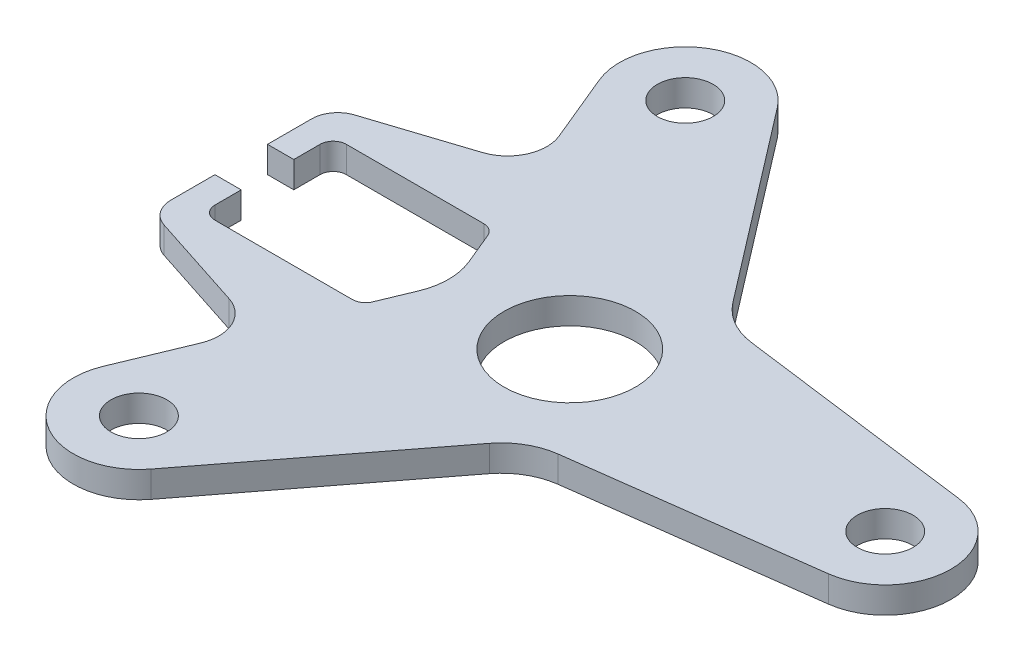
from build123d import *

# Parameters (mm, degrees)
ESQUISSE1_R        = 2.125
ESQUISSE1_R_2      = 5
BOSS_EXTRU_1_DEPTH = 1


with BuildPart() as part:
    # Esquisse1 → Boss.-Extru.1 (new, symmetric)
    with BuildSketch(Plane(origin=(0, 0, 0), x_dir=(1, 0, 0), z_dir=(0, 1, 0))):
        with BuildLine():
            Line((24.652630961, 4.957224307), (6.454696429, 7.353027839))
            ThreePointArc((6.454696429, 7.353027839), (4.60732739, 7.980125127), (3.140560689, 9.266445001))
            Line((3.140560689, 9.266445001), (-8.033233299, 23.828416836))
            ThreePointArc((-8.033233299, 23.828416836), (-14.5, 25.11473671), (-16.619397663, 18.871192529))
            Line((-16.619397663, 18.871192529), (-14.449355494, 13.632247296))
            ThreePointArc((-14.449355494, 13.632247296), (-14.49656457, 11.228217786), (-16.293943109, 9.63102745))
            Line((-16.293943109, 9.63102745), (-23.618033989, 7.251286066))
            ThreePointArc((-23.618033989, 7.251286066), (-24.618033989, 6.524743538), (-25, 5.349173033))
            Line((-25, 5.349173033), (-25, 2))
            Line((-25, 2), (-23, 2))
            Line((-23, 2), (-23, 4))
            ThreePointArc((-23, 4), (-22.707106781, 4.707106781), (-22, 5))
            Line((-22, 5), (-11.541940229, 5))
            ThreePointArc((-11.541940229, 5), (-10.986369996, 4.831469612), (-10.618060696, 4.382683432))
            Line((-10.618060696, 4.382683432), (-9.595257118, 1.913417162))
            ThreePointArc((-9.595257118, 1.913417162), (-9.21465478, 0), (-9.595257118, -1.913417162))
            Line((-9.595257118, -1.913417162), (-10.618060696, -4.382683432))
            ThreePointArc((-10.618060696, -4.382683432), (-10.986369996, -4.831469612), (-11.541940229, -5))
            Line((-11.541940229, -5), (-22, -5))
            ThreePointArc((-22, -5), (-22.707106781, -4.707106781), (-23, -4))
            Line((-23, -4), (-23, -2))
            Line((-23, -2), (-25, -2))
            Line((-25, -2), (-25, -5.349173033))
            ThreePointArc((-25, -5.349173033), (-24.618033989, -6.524743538), (-23.618033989, -7.251286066))
            Line((-23.618033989, -7.251286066), (-16.293943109, -9.63102745))
            ThreePointArc((-16.293943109, -9.63102745), (-14.49656457, -11.228217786), (-14.449355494, -13.632247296))
            Line((-14.449355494, -13.632247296), (-16.619397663, -18.871192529))
            ThreePointArc((-16.619397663, -18.871192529), (-14.5, -25.11473671), (-8.033233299, -23.828416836))
            Line((-8.033233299, -23.828416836), (3.140560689, -9.266445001))
            ThreePointArc((3.140560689, -9.266445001), (4.60732739, -7.980125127), (6.454696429, -7.353027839))
            Line((6.454696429, -7.353027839), (24.652630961, -4.957224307))
            ThreePointArc((24.652630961, -4.957224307), (29, 0), (24.652630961, 4.957224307))
        make_face()
        with Locations(Location((24, 0, 0), (0, 0, 270))):
            Circle(ESQUISSE1_R, mode=Mode.SUBTRACT)
        with Locations(Location((-12, -20.784609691, 0), (0, 0, 270))):
            Circle(ESQUISSE1_R, mode=Mode.SUBTRACT)
        with Locations(Location((-12, 20.784609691, 0), (0, 0, 270))):
            Circle(ESQUISSE1_R, mode=Mode.SUBTRACT)
        with Locations(Location((0, 0, 0), (0, 0, 270))):
            Circle(ESQUISSE1_R_2, mode=Mode.SUBTRACT)
    extrude(amount=BOSS_EXTRU_1_DEPTH, both=True)


solid = part.part
